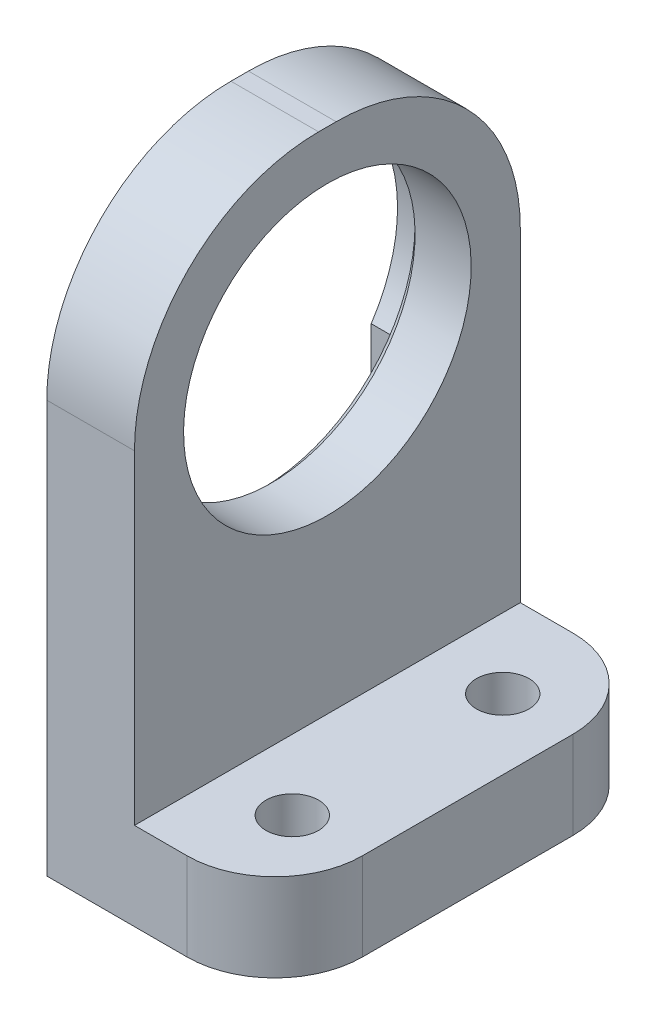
from build123d import *

# Parameters (mm, degrees)
BOSS_EXTRU_1_DEPTH      = 22
ESQUISSE2_R             = 8.2
ENL_V_MAT_EXTRU_1_DEPTH = 42.279534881
CONG_1_R                = 10.5
ENL_V_MAT_EXTRU_2_DEPTH = 1.3
ESQUISSE4_R             = 1.5
ENL_V_MAT_EXTRU_3_DEPTH = 39.65229618
CONG_3_R                = 5
CHANFREIN1_SIZE         = 0.5


with BuildPart() as part:
    # Esquisse1 → Boss.-Extru.1 (new body)
    with BuildSketch(Plane.XY):
        Polygon((0, 0), (0, 34), (5, 34), (5, 5), (13, 5), (13, 0), align=None)
    extrude(amount=BOSS_EXTRU_1_DEPTH)

    # Esquisse2 → Enl_v. mat.-Extru.1 (cut, through all)
    with BuildSketch(Plane(origin=(5, 0, 0), x_dir=(0, 0, -1), z_dir=(1, 0, 0))):
        with Locations(Location((-11, 23, 0), (0, 0, 90))):
            Circle(ESQUISSE2_R)
    extrude(amount=-ENL_V_MAT_EXTRU_1_DEPTH, mode=Mode.SUBTRACT)

    # Cong_1
    cong_1_edges = [part.edges().sort_by_distance(p)[0] for p in [
        (2.5, 34, 22),
        (2.5, 34, 0),
    ]]
    fillet(cong_1_edges, radius=CONG_1_R)

    # Esquisse3 → Enl_v. mat.-Extru.2 (cut)
    with BuildSketch(Plane.ZY):
        with BuildLine():
            Line((3.5, 18.025062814), (3.5, -2.181605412))
            Line((3.5, -2.181605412), (18.5, -2.181605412))
            Line((18.5, -2.181605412), (18.5, 18.025062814))
            ThreePointArc((18.5, 18.025062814), (11, 32), (3.5, 18.025062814))
        make_face()
    extrude(amount=-ENL_V_MAT_EXTRU_2_DEPTH, mode=Mode.SUBTRACT)

    # Esquisse4 → Enl_v. mat.-Extru.3 (cut, through all)
    with BuildSketch(Plane(origin=(0, 5, 0), x_dir=(1, 0, 0), z_dir=(0, 1, 0))):
        with Locations(Location((9, -5, 0), (0, 0, 180))):
            Circle(ESQUISSE4_R)
        with Locations(Location((9, -17, 0), (0, 0, 180))):
            Circle(ESQUISSE4_R)
    extrude(amount=-ENL_V_MAT_EXTRU_3_DEPTH, mode=Mode.SUBTRACT)

    # Cong_3
    cong_3_edges = [part.edges().sort_by_distance(p)[0] for p in [
        (13, 2.5, 22),
        (13, 2.5, 0),
    ]]
    fillet(cong_3_edges, radius=CONG_3_R)

    # Chanfrein1
    chanfrein1_edges = [part.edges().sort_by_distance(p)[0] for p in [
        (1.3, 14.8, 11),
    ]]
    chamfer(chanfrein1_edges, length=CHANFREIN1_SIZE)


solid = part.part
